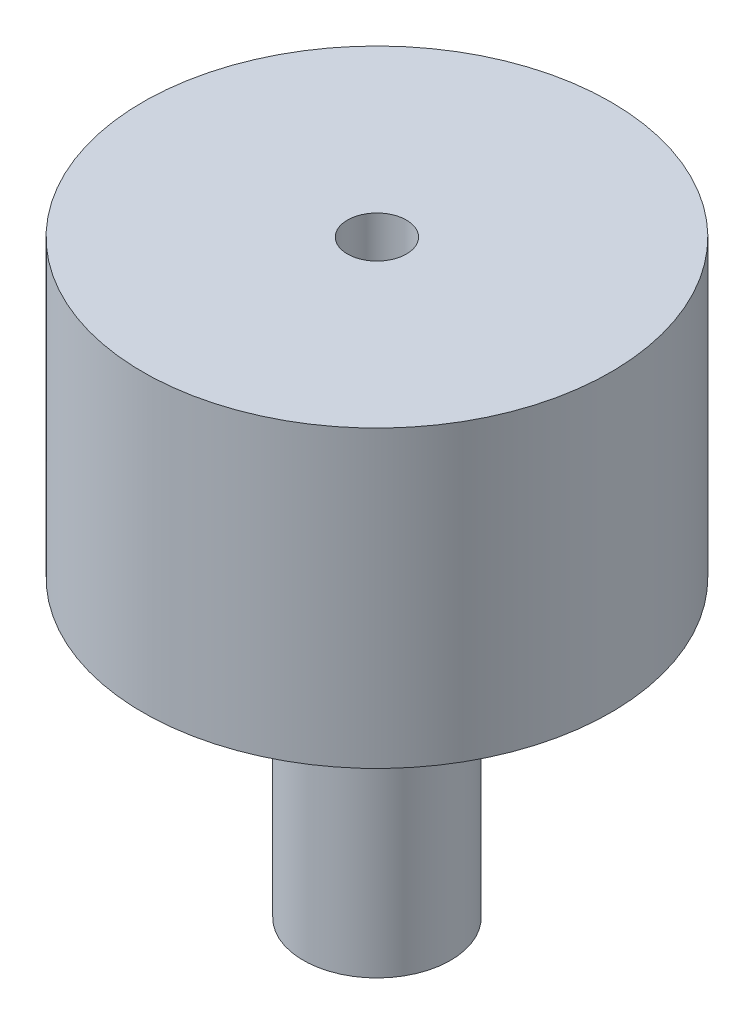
ISO-10303-21;
HEADER;
FILE_DESCRIPTION(('STEP AP214'),'2;1');
FILE_NAME('part.step','',(''),(''),'','','');
FILE_SCHEMA(('AUTOMOTIVE_DESIGN { 1 0 10303 214 1 1 1 1 }'));
ENDSEC;
DATA;
#1=APPLICATION_CONTEXT('core data for automotive mechanical design processes');
#2=APPLICATION_PROTOCOL_DEFINITION('international standard','automotive_design',2000,#1);
#3=PRODUCT_CONTEXT('',#1,'mechanical');
#4=PRODUCT('Part','Part','',(#3));
#5=PRODUCT_RELATED_PRODUCT_CATEGORY('part','',(#4));
#6=PRODUCT_DEFINITION_FORMATION('','',#4);
#7=PRODUCT_DEFINITION_CONTEXT('part definition',#1,'design');
#8=PRODUCT_DEFINITION('design','',#6,#7);
#9=PRODUCT_DEFINITION_SHAPE('','',#8);
#10=(LENGTH_UNIT() NAMED_UNIT(*) SI_UNIT(.MILLI.,.METRE.));
#11=(NAMED_UNIT(*) PLANE_ANGLE_UNIT() SI_UNIT($,.RADIAN.));
#12=(NAMED_UNIT(*) SI_UNIT($,.STERADIAN.) SOLID_ANGLE_UNIT());
#13=UNCERTAINTY_MEASURE_WITH_UNIT(LENGTH_MEASURE(1.E-05),#10,'distance_accuracy_value','');
#14=(GEOMETRIC_REPRESENTATION_CONTEXT(3) GLOBAL_UNCERTAINTY_ASSIGNED_CONTEXT((#13)) GLOBAL_UNIT_ASSIGNED_CONTEXT((#10,
#11,#12)) REPRESENTATION_CONTEXT('',''));
#15=CARTESIAN_POINT('',(0.,0.,0.));
#16=DIRECTION('',(0.,0.,1.));
#17=DIRECTION('',(1.,0.,0.));
#18=AXIS2_PLACEMENT_3D('',#15,#16,#17);
#19=CARTESIAN_POINT('',(0.,2.,0.));
#20=DIRECTION('',(0.,-1.,0.));
#21=DIRECTION('',(0.,0.,-1.));
#22=AXIS2_PLACEMENT_3D('',#19,#20,#21);
#23=PLANE('',#22);
#24=CARTESIAN_POINT('',(0.,2.,0.));
#25=DIRECTION('',(0.,1.,0.));
#26=DIRECTION('',(0.,0.,1.));
#27=AXIS2_PLACEMENT_3D('',#24,#25,#26);
#28=CIRCLE('',#27,0.199999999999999);
#29=CARTESIAN_POINT('',(0.,2.,0.199999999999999));
#30=VERTEX_POINT('',#29);
#31=EDGE_CURVE('E53',#30,#30,#28,.T.);
#32=ORIENTED_EDGE('',*,*,#31,.F.);
#33=EDGE_LOOP('',(#32));
#34=FACE_BOUND('',#33,.T.);
#35=CARTESIAN_POINT('',(0.,2.,0.));
#36=DIRECTION('',(0.,-1.,0.));
#37=DIRECTION('',(0.,0.,-1.));
#38=AXIS2_PLACEMENT_3D('',#35,#36,#37);
#39=CIRCLE('',#38,1.5875);
#40=CARTESIAN_POINT('',(0.,2.,-1.5875));
#41=VERTEX_POINT('',#40);
#42=EDGE_CURVE('E10',#41,#41,#39,.T.);
#43=ORIENTED_EDGE('',*,*,#42,.F.);
#44=EDGE_LOOP('',(#43));
#45=FACE_BOUND('',#44,.T.);
#46=ADVANCED_FACE('F31',(#34,#45),#23,.F.);
#47=CARTESIAN_POINT('',(0.,-50.,0.));
#48=DIRECTION('',(0.,-1.,0.));
#49=DIRECTION('',(0.,0.,-1.));
#50=AXIS2_PLACEMENT_3D('',#47,#48,#49);
#51=CYLINDRICAL_SURFACE('',#50,1.5875);
#52=CARTESIAN_POINT('',(0.,0.,0.));
#53=DIRECTION('',(0.,-1.,0.));
#54=DIRECTION('',(0.,0.,-1.));
#55=AXIS2_PLACEMENT_3D('',#52,#53,#54);
#56=CIRCLE('',#55,1.5875);
#57=CARTESIAN_POINT('',(0.,0.,-1.5875));
#58=VERTEX_POINT('',#57);
#59=EDGE_CURVE('E37',#58,#58,#56,.T.);
#60=ORIENTED_EDGE('',*,*,#59,.F.);
#61=EDGE_LOOP('',(#60));
#62=FACE_BOUND('',#61,.T.);
#63=ORIENTED_EDGE('',*,*,#42,.T.);
#64=EDGE_LOOP('',(#63));
#65=FACE_BOUND('',#64,.T.);
#66=ADVANCED_FACE('F61',(#62,#65),#51,.T.);
#67=CARTESIAN_POINT('',(0.,0.,1.5875));
#68=DIRECTION('',(0.,1.,0.));
#69=DIRECTION('',(0.,0.,1.));
#70=AXIS2_PLACEMENT_3D('',#67,#68,#69);
#71=PLANE('',#70);
#72=CARTESIAN_POINT('',(0.,0.,0.));
#73=DIRECTION('',(0.,-1.,0.));
#74=DIRECTION('',(0.,0.,-1.));
#75=AXIS2_PLACEMENT_3D('',#72,#73,#74);
#76=CIRCLE('',#75,0.5);
#77=CARTESIAN_POINT('',(0.,0.,-0.5));
#78=VERTEX_POINT('',#77);
#79=EDGE_CURVE('E41',#78,#78,#76,.T.);
#80=ORIENTED_EDGE('',*,*,#79,.F.);
#81=EDGE_LOOP('',(#80));
#82=FACE_BOUND('',#81,.T.);
#83=ORIENTED_EDGE('',*,*,#59,.T.);
#84=EDGE_LOOP('',(#83));
#85=FACE_BOUND('',#84,.T.);
#86=ADVANCED_FACE('F65',(#82,#85),#71,.F.);
#87=CARTESIAN_POINT('',(0.,-50.,0.));
#88=DIRECTION('',(0.,-1.,0.));
#89=DIRECTION('',(0.,0.,-1.));
#90=AXIS2_PLACEMENT_3D('',#87,#88,#89);
#91=CYLINDRICAL_SURFACE('',#90,0.5);
#92=CARTESIAN_POINT('',(0.,-2.,0.));
#93=DIRECTION('',(0.,-1.,0.));
#94=DIRECTION('',(0.,0.,-1.));
#95=AXIS2_PLACEMENT_3D('',#92,#93,#94);
#96=CIRCLE('',#95,0.5);
#97=CARTESIAN_POINT('',(0.,-2.,-0.5));
#98=VERTEX_POINT('',#97);
#99=EDGE_CURVE('E45',#98,#98,#96,.T.);
#100=ORIENTED_EDGE('',*,*,#99,.F.);
#101=EDGE_LOOP('',(#100));
#102=FACE_BOUND('',#101,.T.);
#103=ORIENTED_EDGE('',*,*,#79,.T.);
#104=EDGE_LOOP('',(#103));
#105=FACE_BOUND('',#104,.T.);
#106=ADVANCED_FACE('F70',(#102,#105),#91,.T.);
#107=CARTESIAN_POINT('',(0.,-2.,0.5));
#108=DIRECTION('',(0.,1.,0.));
#109=DIRECTION('',(0.,0.,1.));
#110=AXIS2_PLACEMENT_3D('',#107,#108,#109);
#111=PLANE('',#110);
#112=CARTESIAN_POINT('',(0.,-2.,0.));
#113=DIRECTION('',(0.,1.,0.));
#114=DIRECTION('',(0.,0.,1.));
#115=AXIS2_PLACEMENT_3D('',#112,#113,#114);
#116=CIRCLE('',#115,0.199999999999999);
#117=CARTESIAN_POINT('',(0.,-2.,0.199999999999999));
#118=VERTEX_POINT('',#117);
#119=EDGE_CURVE('E50',#118,#118,#116,.T.);
#120=ORIENTED_EDGE('',*,*,#119,.T.);
#121=EDGE_LOOP('',(#120));
#122=FACE_BOUND('',#121,.T.);
#123=ORIENTED_EDGE('',*,*,#99,.T.);
#124=EDGE_LOOP('',(#123));
#125=FACE_BOUND('',#124,.T.);
#126=ADVANCED_FACE('F76',(#122,#125),#111,.F.);
#127=CARTESIAN_POINT('',(0.,2.,0.));
#128=DIRECTION('',(0.,1.,0.));
#129=DIRECTION('',(0.,0.,1.));
#130=AXIS2_PLACEMENT_3D('',#127,#128,#129);
#131=CYLINDRICAL_SURFACE('',#130,0.199999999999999);
#132=ORIENTED_EDGE('',*,*,#119,.F.);
#133=EDGE_LOOP('',(#132));
#134=FACE_BOUND('',#133,.T.);
#135=ORIENTED_EDGE('',*,*,#31,.T.);
#136=EDGE_LOOP('',(#135));
#137=FACE_BOUND('',#136,.T.);
#138=ADVANCED_FACE('F57',(#134,#137),#131,.F.);
#139=CLOSED_SHELL('',(#46,#66,#86,#106,#126,#138));
#140=MANIFOLD_SOLID_BREP('B2',#139);
#141=ADVANCED_BREP_SHAPE_REPRESENTATION('',(#18,#140),#14);
#142=SHAPE_DEFINITION_REPRESENTATION(#9,#141);
ENDSEC;
END-ISO-10303-21;
